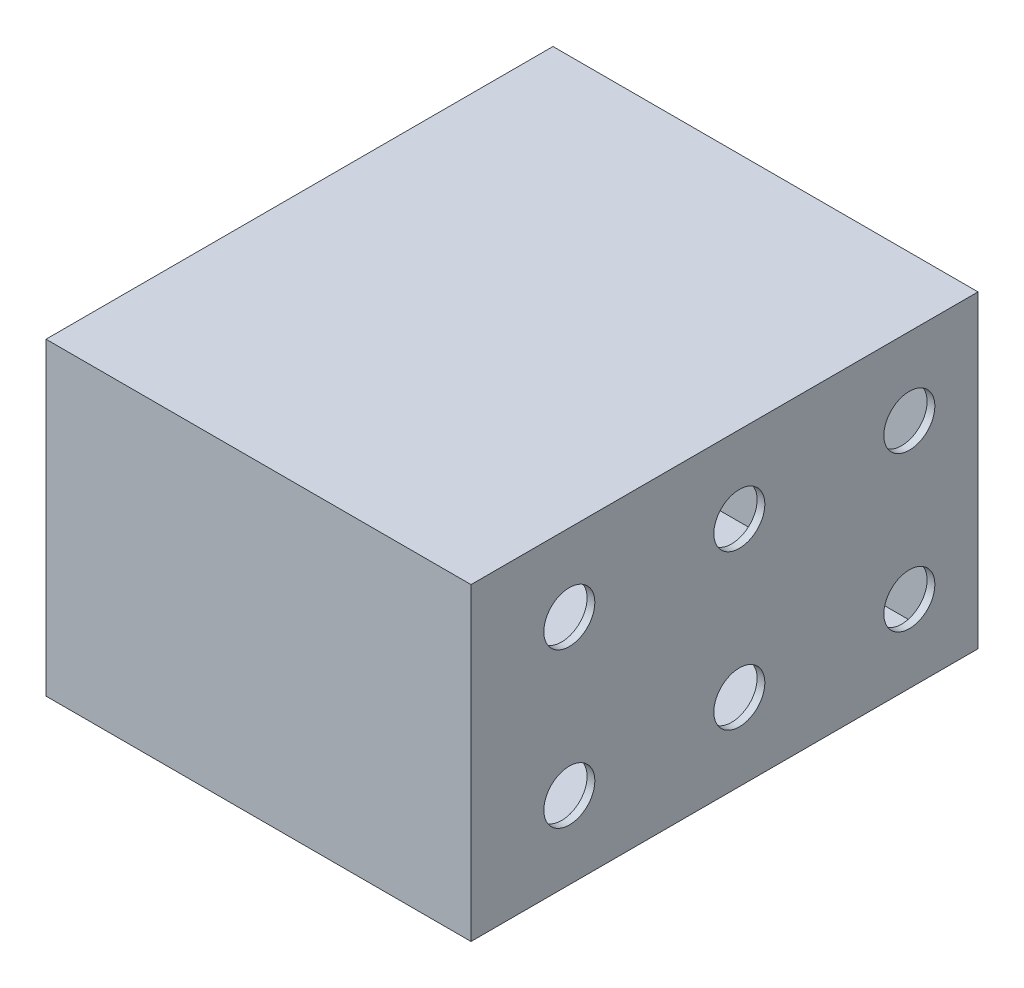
ISO-10303-21;
HEADER;
FILE_DESCRIPTION(('STEP AP214'),'2;1');
FILE_NAME('part.step','',(''),(''),'','','');
FILE_SCHEMA(('AUTOMOTIVE_DESIGN { 1 0 10303 214 1 1 1 1 }'));
ENDSEC;
DATA;
#1=APPLICATION_CONTEXT('core data for automotive mechanical design processes');
#2=APPLICATION_PROTOCOL_DEFINITION('international standard','automotive_design',2000,#1);
#3=PRODUCT_CONTEXT('',#1,'mechanical');
#4=PRODUCT('Part','Part','',(#3));
#5=PRODUCT_RELATED_PRODUCT_CATEGORY('part','',(#4));
#6=PRODUCT_DEFINITION_FORMATION('','',#4);
#7=PRODUCT_DEFINITION_CONTEXT('part definition',#1,'design');
#8=PRODUCT_DEFINITION('design','',#6,#7);
#9=PRODUCT_DEFINITION_SHAPE('','',#8);
#10=(LENGTH_UNIT() NAMED_UNIT(*) SI_UNIT(.MILLI.,.METRE.));
#11=(NAMED_UNIT(*) PLANE_ANGLE_UNIT() SI_UNIT($,.RADIAN.));
#12=(NAMED_UNIT(*) SI_UNIT($,.STERADIAN.) SOLID_ANGLE_UNIT());
#13=UNCERTAINTY_MEASURE_WITH_UNIT(LENGTH_MEASURE(1.E-05),#10,'distance_accuracy_value','');
#14=(GEOMETRIC_REPRESENTATION_CONTEXT(3) GLOBAL_UNCERTAINTY_ASSIGNED_CONTEXT((#13)) GLOBAL_UNIT_ASSIGNED_CONTEXT((#10,
#11,#12)) REPRESENTATION_CONTEXT('',''));
#15=CARTESIAN_POINT('',(0.,0.,0.));
#16=DIRECTION('',(0.,0.,1.));
#17=DIRECTION('',(1.,0.,0.));
#18=AXIS2_PLACEMENT_3D('',#15,#16,#17);
#19=CARTESIAN_POINT('',(26.5,15.,-25.5584012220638));
#20=DIRECTION('',(1.,0.,0.));
#21=DIRECTION('',(0.,0.,-1.));
#22=AXIS2_PLACEMENT_3D('',#19,#20,#21);
#23=CYLINDRICAL_SURFACE('',#22,1.65);
#24=CARTESIAN_POINT('',(27.5,15.,-25.5584012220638));
#25=DIRECTION('',(1.,0.,0.));
#26=DIRECTION('',(0.,0.,-1.));
#27=AXIS2_PLACEMENT_3D('',#24,#25,#26);
#28=CIRCLE('',#27,1.65);
#29=CARTESIAN_POINT('',(27.5,15.,-27.2084012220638));
#30=VERTEX_POINT('',#29);
#31=EDGE_CURVE('E48',#30,#30,#28,.T.);
#32=ORIENTED_EDGE('',*,*,#31,.T.);
#33=EDGE_LOOP('',(#32));
#34=FACE_BOUND('',#33,.T.);
#35=CARTESIAN_POINT('',(27.,15.,-25.5584012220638));
#36=DIRECTION('',(1.,0.,0.));
#37=DIRECTION('',(0.,0.,-1.));
#38=AXIS2_PLACEMENT_3D('',#35,#36,#37);
#39=CIRCLE('',#38,1.65);
#40=CARTESIAN_POINT('',(27.,15.,-27.2084012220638));
#41=VERTEX_POINT('',#40);
#42=EDGE_CURVE('E11',#41,#41,#39,.T.);
#43=ORIENTED_EDGE('',*,*,#42,.F.);
#44=EDGE_LOOP('',(#43));
#45=FACE_BOUND('',#44,.T.);
#46=ADVANCED_FACE('F41',(#34,#45),#23,.F.);
#47=CARTESIAN_POINT('',(26.5,5.,-25.5584012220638));
#48=DIRECTION('',(1.,0.,0.));
#49=DIRECTION('',(0.,0.,-1.));
#50=AXIS2_PLACEMENT_3D('',#47,#48,#49);
#51=CYLINDRICAL_SURFACE('',#50,1.65);
#52=CARTESIAN_POINT('',(27.5,5.,-25.5584012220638));
#53=DIRECTION('',(1.,0.,0.));
#54=DIRECTION('',(0.,0.,-1.));
#55=AXIS2_PLACEMENT_3D('',#52,#53,#54);
#56=CIRCLE('',#55,1.65);
#57=CARTESIAN_POINT('',(27.5,5.,-27.2084012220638));
#58=VERTEX_POINT('',#57);
#59=EDGE_CURVE('E185',#58,#58,#56,.T.);
#60=ORIENTED_EDGE('',*,*,#59,.T.);
#61=EDGE_LOOP('',(#60));
#62=FACE_BOUND('',#61,.T.);
#63=CARTESIAN_POINT('',(27.,5.,-25.5584012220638));
#64=DIRECTION('',(1.,0.,0.));
#65=DIRECTION('',(0.,0.,-1.));
#66=AXIS2_PLACEMENT_3D('',#63,#64,#65);
#67=CIRCLE('',#66,1.65);
#68=CARTESIAN_POINT('',(27.,5.,-27.2084012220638));
#69=VERTEX_POINT('',#68);
#70=EDGE_CURVE('E193',#69,#69,#67,.T.);
#71=ORIENTED_EDGE('',*,*,#70,.F.);
#72=EDGE_LOOP('',(#71));
#73=FACE_BOUND('',#72,.T.);
#74=ADVANCED_FACE('F217',(#62,#73),#51,.F.);
#75=CARTESIAN_POINT('',(27.5,0.,-30.));
#76=DIRECTION('',(0.,0.,1.));
#77=DIRECTION('',(1.,0.,0.));
#78=AXIS2_PLACEMENT_3D('',#75,#76,#77);
#79=PLANE('',#78);
#80=DIRECTION('',(0.,1.,0.));
#81=VECTOR('',#80,1.);
#82=CARTESIAN_POINT('',(0.,0.,-30.));
#83=LINE('',#82,#81);
#84=CARTESIAN_POINT('',(0.,0.,-30.));
#85=VERTEX_POINT('',#84);
#86=CARTESIAN_POINT('',(0.,20.,-30.));
#87=VERTEX_POINT('',#86);
#88=EDGE_CURVE('E156',#85,#87,#83,.T.);
#89=ORIENTED_EDGE('',*,*,#88,.T.);
#90=DIRECTION('',(-1.,0.,0.));
#91=VECTOR('',#90,1.);
#92=CARTESIAN_POINT('',(27.5,20.,-30.));
#93=LINE('',#92,#91);
#94=CARTESIAN_POINT('',(27.5,20.,-30.));
#95=VERTEX_POINT('',#94);
#96=EDGE_CURVE('E179',#95,#87,#93,.T.);
#97=ORIENTED_EDGE('',*,*,#96,.F.);
#98=DIRECTION('',(0.,1.,0.));
#99=VECTOR('',#98,1.);
#100=CARTESIAN_POINT('',(27.5,0.,-30.));
#101=LINE('',#100,#99);
#102=CARTESIAN_POINT('',(27.5,0.,-30.));
#103=VERTEX_POINT('',#102);
#104=EDGE_CURVE('E94',#103,#95,#101,.T.);
#105=ORIENTED_EDGE('',*,*,#104,.F.);
#106=DIRECTION('',(-1.,0.,0.));
#107=VECTOR('',#106,1.);
#108=CARTESIAN_POINT('',(27.5,0.,-30.));
#109=LINE('',#108,#107);
#110=EDGE_CURVE('E176',#103,#85,#109,.T.);
#111=ORIENTED_EDGE('',*,*,#110,.T.);
#112=EDGE_LOOP('',(#89,#97,#105,#111));
#113=FACE_BOUND('',#112,.T.);
#114=ADVANCED_FACE('F225',(#113),#79,.F.);
#115=CARTESIAN_POINT('',(27.5,20.,2.80262364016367));
#116=DIRECTION('',(0.,-1.,0.));
#117=DIRECTION('',(0.,0.,-1.));
#118=AXIS2_PLACEMENT_3D('',#115,#116,#117);
#119=PLANE('',#118);
#120=DIRECTION('',(0.,0.,1.));
#121=VECTOR('',#120,1.);
#122=CARTESIAN_POINT('',(0.,20.,2.80262364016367));
#123=LINE('',#122,#121);
#124=CARTESIAN_POINT('',(0.,20.,2.80262364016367));
#125=VERTEX_POINT('',#124);
#126=EDGE_CURVE('E168',#87,#125,#123,.T.);
#127=ORIENTED_EDGE('',*,*,#126,.T.);
#128=DIRECTION('',(-1.,0.,0.));
#129=VECTOR('',#128,1.);
#130=CARTESIAN_POINT('',(27.5,20.,2.80262364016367));
#131=LINE('',#130,#129);
#132=CARTESIAN_POINT('',(27.5,20.,2.80262364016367));
#133=VERTEX_POINT('',#132);
#134=EDGE_CURVE('E171',#133,#125,#131,.T.);
#135=ORIENTED_EDGE('',*,*,#134,.F.);
#136=DIRECTION('',(0.,0.,1.));
#137=VECTOR('',#136,1.);
#138=CARTESIAN_POINT('',(27.5,20.,0.));
#139=LINE('',#138,#137);
#140=EDGE_CURVE('E162',#95,#133,#139,.T.);
#141=ORIENTED_EDGE('',*,*,#140,.F.);
#142=ORIENTED_EDGE('',*,*,#96,.T.);
#143=EDGE_LOOP('',(#127,#135,#141,#142));
#144=FACE_BOUND('',#143,.T.);
#145=ADVANCED_FACE('F230',(#144),#119,.F.);
#146=CARTESIAN_POINT('',(27.5,0.,2.80262364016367));
#147=DIRECTION('',(0.,0.,-1.));
#148=DIRECTION('',(-1.,0.,0.));
#149=AXIS2_PLACEMENT_3D('',#146,#147,#148);
#150=PLANE('',#149);
#151=DIRECTION('',(0.,-1.,0.));
#152=VECTOR('',#151,1.);
#153=CARTESIAN_POINT('',(0.,0.,2.80262364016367));
#154=LINE('',#153,#152);
#155=CARTESIAN_POINT('',(0.,0.,2.80262364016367));
#156=VERTEX_POINT('',#155);
#157=EDGE_CURVE('E87',#125,#156,#154,.T.);
#158=ORIENTED_EDGE('',*,*,#157,.T.);
#159=DIRECTION('',(-1.,0.,0.));
#160=VECTOR('',#159,1.);
#161=CARTESIAN_POINT('',(27.5,0.,2.80262364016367));
#162=LINE('',#161,#160);
#163=CARTESIAN_POINT('',(27.5,0.,2.80262364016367));
#164=VERTEX_POINT('',#163);
#165=EDGE_CURVE('E170',#164,#156,#162,.T.);
#166=ORIENTED_EDGE('',*,*,#165,.F.);
#167=DIRECTION('',(0.,-1.,0.));
#168=VECTOR('',#167,1.);
#169=CARTESIAN_POINT('',(27.5,0.,2.80262364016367));
#170=LINE('',#169,#168);
#171=EDGE_CURVE('E164',#133,#164,#170,.T.);
#172=ORIENTED_EDGE('',*,*,#171,.F.);
#173=ORIENTED_EDGE('',*,*,#134,.T.);
#174=EDGE_LOOP('',(#158,#166,#172,#173));
#175=FACE_BOUND('',#174,.T.);
#176=ADVANCED_FACE('F215',(#175),#150,.F.);
#177=CARTESIAN_POINT('',(27.5,0.,0.));
#178=DIRECTION('',(0.,1.,0.));
#179=DIRECTION('',(0.,0.,1.));
#180=AXIS2_PLACEMENT_3D('',#177,#178,#179);
#181=PLANE('',#180);
#182=DIRECTION('',(0.,0.,-1.));
#183=VECTOR('',#182,1.);
#184=CARTESIAN_POINT('',(0.,0.,0.));
#185=LINE('',#184,#183);
#186=EDGE_CURVE('E161',#156,#85,#185,.T.);
#187=ORIENTED_EDGE('',*,*,#186,.T.);
#188=ORIENTED_EDGE('',*,*,#110,.F.);
#189=DIRECTION('',(0.,0.,-1.));
#190=VECTOR('',#189,1.);
#191=CARTESIAN_POINT('',(27.5,0.,0.));
#192=LINE('',#191,#190);
#193=EDGE_CURVE('E64',#164,#103,#192,.T.);
#194=ORIENTED_EDGE('',*,*,#193,.F.);
#195=ORIENTED_EDGE('',*,*,#165,.T.);
#196=EDGE_LOOP('',(#187,#188,#194,#195));
#197=FACE_BOUND('',#196,.T.);
#198=ADVANCED_FACE('F203',(#197),#181,.F.);
#199=CARTESIAN_POINT('',(27.5,0.,0.));
#200=DIRECTION('',(1.,0.,0.));
#201=DIRECTION('',(0.,0.,-1.));
#202=AXIS2_PLACEMENT_3D('',#199,#200,#201);
#203=PLANE('',#202);
#204=CARTESIAN_POINT('',(27.5,15.,-14.5584012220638));
#205=DIRECTION('',(1.,0.,0.));
#206=DIRECTION('',(0.,0.,-1.));
#207=AXIS2_PLACEMENT_3D('',#204,#205,#206);
#208=CIRCLE('',#207,1.65);
#209=CARTESIAN_POINT('',(27.5,15.,-16.2084012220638));
#210=VERTEX_POINT('',#209);
#211=EDGE_CURVE('E371',#210,#210,#208,.T.);
#212=ORIENTED_EDGE('',*,*,#211,.F.);
#213=EDGE_LOOP('',(#212));
#214=FACE_BOUND('',#213,.T.);
#215=CARTESIAN_POINT('',(27.5,5.,-14.5584012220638));
#216=DIRECTION('',(1.,0.,0.));
#217=DIRECTION('',(0.,0.,-1.));
#218=AXIS2_PLACEMENT_3D('',#215,#216,#217);
#219=CIRCLE('',#218,1.65);
#220=CARTESIAN_POINT('',(27.5,5.,-16.2084012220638));
#221=VERTEX_POINT('',#220);
#222=EDGE_CURVE('E348',#221,#221,#219,.T.);
#223=ORIENTED_EDGE('',*,*,#222,.F.);
#224=EDGE_LOOP('',(#223));
#225=FACE_BOUND('',#224,.T.);
#226=CARTESIAN_POINT('',(27.5,5.,-3.55840122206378));
#227=DIRECTION('',(1.,0.,0.));
#228=DIRECTION('',(0.,0.,-1.));
#229=AXIS2_PLACEMENT_3D('',#226,#227,#228);
#230=CIRCLE('',#229,1.65);
#231=CARTESIAN_POINT('',(27.5,5.,-5.20840122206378));
#232=VERTEX_POINT('',#231);
#233=EDGE_CURVE('E187',#232,#232,#230,.T.);
#234=ORIENTED_EDGE('',*,*,#233,.F.);
#235=EDGE_LOOP('',(#234));
#236=FACE_BOUND('',#235,.T.);
#237=CARTESIAN_POINT('',(27.5,15.,-3.55840122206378));
#238=DIRECTION('',(1.,0.,0.));
#239=DIRECTION('',(0.,0.,-1.));
#240=AXIS2_PLACEMENT_3D('',#237,#238,#239);
#241=CIRCLE('',#240,1.65);
#242=CARTESIAN_POINT('',(27.5,15.,-5.20840122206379));
#243=VERTEX_POINT('',#242);
#244=EDGE_CURVE('E141',#243,#243,#241,.T.);
#245=ORIENTED_EDGE('',*,*,#244,.F.);
#246=EDGE_LOOP('',(#245));
#247=FACE_BOUND('',#246,.T.);
#248=ORIENTED_EDGE('',*,*,#193,.T.);
#249=ORIENTED_EDGE('',*,*,#104,.T.);
#250=ORIENTED_EDGE('',*,*,#140,.T.);
#251=ORIENTED_EDGE('',*,*,#171,.T.);
#252=EDGE_LOOP('',(#248,#249,#250,#251));
#253=FACE_BOUND('',#252,.T.);
#254=ORIENTED_EDGE('',*,*,#59,.F.);
#255=EDGE_LOOP('',(#254));
#256=FACE_BOUND('',#255,.T.);
#257=ORIENTED_EDGE('',*,*,#31,.F.);
#258=EDGE_LOOP('',(#257));
#259=FACE_BOUND('',#258,.T.);
#260=ADVANCED_FACE('F196',(#214,#225,#236,#247,#253,#256,#259),#203,.T.);
#261=CARTESIAN_POINT('',(0.,0.,0.));
#262=DIRECTION('',(1.,0.,0.));
#263=DIRECTION('',(0.,0.,-1.));
#264=AXIS2_PLACEMENT_3D('',#261,#262,#263);
#265=PLANE('',#264);
#266=DIRECTION('',(0.,1.,0.));
#267=VECTOR('',#266,1.);
#268=CARTESIAN_POINT('',(0.,19.639542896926,1.99062042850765));
#269=LINE('',#268,#267);
#270=CARTESIAN_POINT('',(0.,0.360457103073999,1.99062042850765));
#271=VERTEX_POINT('',#270);
#272=CARTESIAN_POINT('',(0.,19.639542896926,1.99062042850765));
#273=VERTEX_POINT('',#272);
#274=EDGE_CURVE('E149',#271,#273,#269,.T.);
#275=ORIENTED_EDGE('',*,*,#274,.F.);
#276=DIRECTION('',(0.,0.,1.));
#277=VECTOR('',#276,1.);
#278=CARTESIAN_POINT('',(0.,0.360457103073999,-29.0332451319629));
#279=LINE('',#278,#277);
#280=CARTESIAN_POINT('',(0.,0.360457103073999,-29.0332451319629));
#281=VERTEX_POINT('',#280);
#282=EDGE_CURVE('E54',#281,#271,#279,.T.);
#283=ORIENTED_EDGE('',*,*,#282,.F.);
#284=DIRECTION('',(0.,-1.,0.));
#285=VECTOR('',#284,1.);
#286=CARTESIAN_POINT('',(0.,19.639542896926,-29.0332451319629));
#287=LINE('',#286,#285);
#288=CARTESIAN_POINT('',(0.,19.639542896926,-29.0332451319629));
#289=VERTEX_POINT('',#288);
#290=EDGE_CURVE('E139',#289,#281,#287,.T.);
#291=ORIENTED_EDGE('',*,*,#290,.F.);
#292=DIRECTION('',(0.,0.,-1.));
#293=VECTOR('',#292,1.);
#294=CARTESIAN_POINT('',(0.,19.639542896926,-29.0332451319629));
#295=LINE('',#294,#293);
#296=EDGE_CURVE('E136',#273,#289,#295,.T.);
#297=ORIENTED_EDGE('',*,*,#296,.F.);
#298=EDGE_LOOP('',(#275,#283,#291,#297));
#299=FACE_BOUND('',#298,.T.);
#300=ORIENTED_EDGE('',*,*,#88,.F.);
#301=ORIENTED_EDGE('',*,*,#186,.F.);
#302=ORIENTED_EDGE('',*,*,#157,.F.);
#303=ORIENTED_EDGE('',*,*,#126,.F.);
#304=EDGE_LOOP('',(#300,#301,#302,#303));
#305=FACE_BOUND('',#304,.T.);
#306=ADVANCED_FACE('F199',(#299,#305),#265,.F.);
#307=CARTESIAN_POINT('',(27.,0.360457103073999,-29.0332451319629));
#308=DIRECTION('',(0.,-1.,0.));
#309=DIRECTION('',(0.,0.,-1.));
#310=AXIS2_PLACEMENT_3D('',#307,#308,#309);
#311=PLANE('',#310);
#312=ORIENTED_EDGE('',*,*,#282,.T.);
#313=DIRECTION('',(-1.,0.,0.));
#314=VECTOR('',#313,1.);
#315=CARTESIAN_POINT('',(27.,0.360457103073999,1.99062042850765));
#316=LINE('',#315,#314);
#317=CARTESIAN_POINT('',(27.,0.360457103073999,1.99062042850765));
#318=VERTEX_POINT('',#317);
#319=EDGE_CURVE('E111',#318,#271,#316,.T.);
#320=ORIENTED_EDGE('',*,*,#319,.F.);
#321=DIRECTION('',(0.,0.,1.));
#322=VECTOR('',#321,1.);
#323=CARTESIAN_POINT('',(27.,0.360457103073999,-29.0332451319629));
#324=LINE('',#323,#322);
#325=CARTESIAN_POINT('',(27.,0.360457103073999,-29.0332451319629));
#326=VERTEX_POINT('',#325);
#327=EDGE_CURVE('E118',#326,#318,#324,.T.);
#328=ORIENTED_EDGE('',*,*,#327,.F.);
#329=DIRECTION('',(-1.,0.,0.));
#330=VECTOR('',#329,1.);
#331=CARTESIAN_POINT('',(27.,0.360457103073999,-29.0332451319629));
#332=LINE('',#331,#330);
#333=EDGE_CURVE('E152',#326,#281,#332,.T.);
#334=ORIENTED_EDGE('',*,*,#333,.T.);
#335=EDGE_LOOP('',(#312,#320,#328,#334));
#336=FACE_BOUND('',#335,.T.);
#337=ADVANCED_FACE('F117',(#336),#311,.F.);
#338=CARTESIAN_POINT('',(27.,19.639542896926,-29.0332451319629));
#339=DIRECTION('',(0.,0.,-1.));
#340=DIRECTION('',(-1.,0.,0.));
#341=AXIS2_PLACEMENT_3D('',#338,#339,#340);
#342=PLANE('',#341);
#343=ORIENTED_EDGE('',*,*,#290,.T.);
#344=ORIENTED_EDGE('',*,*,#333,.F.);
#345=DIRECTION('',(0.,-1.,0.));
#346=VECTOR('',#345,1.);
#347=CARTESIAN_POINT('',(27.,19.639542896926,-29.0332451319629));
#348=LINE('',#347,#346);
#349=CARTESIAN_POINT('',(27.,19.639542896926,-29.0332451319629));
#350=VERTEX_POINT('',#349);
#351=EDGE_CURVE('E125',#350,#326,#348,.T.);
#352=ORIENTED_EDGE('',*,*,#351,.F.);
#353=DIRECTION('',(-1.,0.,0.));
#354=VECTOR('',#353,1.);
#355=CARTESIAN_POINT('',(27.,19.639542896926,-29.0332451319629));
#356=LINE('',#355,#354);
#357=EDGE_CURVE('E160',#350,#289,#356,.T.);
#358=ORIENTED_EDGE('',*,*,#357,.T.);
#359=EDGE_LOOP('',(#343,#344,#352,#358));
#360=FACE_BOUND('',#359,.T.);
#361=ADVANCED_FACE('F260',(#360),#342,.F.);
#362=CARTESIAN_POINT('',(27.,19.639542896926,-29.0332451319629));
#363=DIRECTION('',(0.,1.,0.));
#364=DIRECTION('',(0.,0.,1.));
#365=AXIS2_PLACEMENT_3D('',#362,#363,#364);
#366=PLANE('',#365);
#367=ORIENTED_EDGE('',*,*,#296,.T.);
#368=ORIENTED_EDGE('',*,*,#357,.F.);
#369=DIRECTION('',(0.,0.,-1.));
#370=VECTOR('',#369,1.);
#371=CARTESIAN_POINT('',(27.,19.639542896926,-29.0332451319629));
#372=LINE('',#371,#370);
#373=CARTESIAN_POINT('',(27.,19.639542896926,1.99062042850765));
#374=VERTEX_POINT('',#373);
#375=EDGE_CURVE('E135',#374,#350,#372,.T.);
#376=ORIENTED_EDGE('',*,*,#375,.F.);
#377=DIRECTION('',(-1.,0.,0.));
#378=VECTOR('',#377,1.);
#379=CARTESIAN_POINT('',(27.,19.639542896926,1.99062042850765));
#380=LINE('',#379,#378);
#381=EDGE_CURVE('E122',#374,#273,#380,.T.);
#382=ORIENTED_EDGE('',*,*,#381,.T.);
#383=EDGE_LOOP('',(#367,#368,#376,#382));
#384=FACE_BOUND('',#383,.T.);
#385=ADVANCED_FACE('F262',(#384),#366,.F.);
#386=CARTESIAN_POINT('',(27.,19.639542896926,1.99062042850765));
#387=DIRECTION('',(0.,0.,1.));
#388=DIRECTION('',(1.,0.,0.));
#389=AXIS2_PLACEMENT_3D('',#386,#387,#388);
#390=PLANE('',#389);
#391=ORIENTED_EDGE('',*,*,#274,.T.);
#392=ORIENTED_EDGE('',*,*,#381,.F.);
#393=DIRECTION('',(0.,1.,0.));
#394=VECTOR('',#393,1.);
#395=CARTESIAN_POINT('',(27.,19.639542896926,1.99062042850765));
#396=LINE('',#395,#394);
#397=EDGE_CURVE('E130',#318,#374,#396,.T.);
#398=ORIENTED_EDGE('',*,*,#397,.F.);
#399=ORIENTED_EDGE('',*,*,#319,.T.);
#400=EDGE_LOOP('',(#391,#392,#398,#399));
#401=FACE_BOUND('',#400,.T.);
#402=ADVANCED_FACE('F126',(#401),#390,.F.);
#403=CARTESIAN_POINT('',(27.,0.,0.));
#404=DIRECTION('',(1.,0.,0.));
#405=DIRECTION('',(0.,0.,-1.));
#406=AXIS2_PLACEMENT_3D('',#403,#404,#405);
#407=PLANE('',#406);
#408=CARTESIAN_POINT('',(27.,15.,-14.5584012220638));
#409=DIRECTION('',(1.,0.,0.));
#410=DIRECTION('',(0.,0.,-1.));
#411=AXIS2_PLACEMENT_3D('',#408,#409,#410);
#412=CIRCLE('',#411,1.65);
#413=CARTESIAN_POINT('',(27.,15.,-16.2084012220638));
#414=VERTEX_POINT('',#413);
#415=EDGE_CURVE('E339',#414,#414,#412,.T.);
#416=ORIENTED_EDGE('',*,*,#415,.T.);
#417=EDGE_LOOP('',(#416));
#418=FACE_BOUND('',#417,.T.);
#419=CARTESIAN_POINT('',(27.,5.,-14.5584012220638));
#420=DIRECTION('',(1.,0.,0.));
#421=DIRECTION('',(0.,0.,-1.));
#422=AXIS2_PLACEMENT_3D('',#419,#420,#421);
#423=CIRCLE('',#422,1.65);
#424=CARTESIAN_POINT('',(27.,5.,-16.2084012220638));
#425=VERTEX_POINT('',#424);
#426=EDGE_CURVE('E342',#425,#425,#423,.T.);
#427=ORIENTED_EDGE('',*,*,#426,.T.);
#428=EDGE_LOOP('',(#427));
#429=FACE_BOUND('',#428,.T.);
#430=CARTESIAN_POINT('',(27.,5.,-3.55840122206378));
#431=DIRECTION('',(1.,0.,0.));
#432=DIRECTION('',(0.,0.,-1.));
#433=AXIS2_PLACEMENT_3D('',#430,#431,#432);
#434=CIRCLE('',#433,1.65);
#435=CARTESIAN_POINT('',(27.,5.,-5.20840122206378));
#436=VERTEX_POINT('',#435);
#437=EDGE_CURVE('E147',#436,#436,#434,.T.);
#438=ORIENTED_EDGE('',*,*,#437,.T.);
#439=EDGE_LOOP('',(#438));
#440=FACE_BOUND('',#439,.T.);
#441=CARTESIAN_POINT('',(27.,15.,-3.55840122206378));
#442=DIRECTION('',(1.,0.,0.));
#443=DIRECTION('',(0.,0.,-1.));
#444=AXIS2_PLACEMENT_3D('',#441,#442,#443);
#445=CIRCLE('',#444,1.65);
#446=CARTESIAN_POINT('',(27.,15.,-5.20840122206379));
#447=VERTEX_POINT('',#446);
#448=EDGE_CURVE('E181',#447,#447,#445,.T.);
#449=ORIENTED_EDGE('',*,*,#448,.T.);
#450=EDGE_LOOP('',(#449));
#451=FACE_BOUND('',#450,.T.);
#452=ORIENTED_EDGE('',*,*,#327,.T.);
#453=ORIENTED_EDGE('',*,*,#397,.T.);
#454=ORIENTED_EDGE('',*,*,#375,.T.);
#455=ORIENTED_EDGE('',*,*,#351,.T.);
#456=EDGE_LOOP('',(#452,#453,#454,#455));
#457=FACE_BOUND('',#456,.T.);
#458=ORIENTED_EDGE('',*,*,#70,.T.);
#459=EDGE_LOOP('',(#458));
#460=FACE_BOUND('',#459,.T.);
#461=ORIENTED_EDGE('',*,*,#42,.T.);
#462=EDGE_LOOP('',(#461));
#463=FACE_BOUND('',#462,.T.);
#464=ADVANCED_FACE('F134',(#418,#429,#440,#451,#457,#460,#463),#407,.F.);
#465=CARTESIAN_POINT('',(26.5,15.,-3.55840122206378));
#466=DIRECTION('',(1.,0.,0.));
#467=DIRECTION('',(0.,0.,-1.));
#468=AXIS2_PLACEMENT_3D('',#465,#466,#467);
#469=CYLINDRICAL_SURFACE('',#468,1.65);
#470=ORIENTED_EDGE('',*,*,#244,.T.);
#471=EDGE_LOOP('',(#470));
#472=FACE_BOUND('',#471,.T.);
#473=ORIENTED_EDGE('',*,*,#448,.F.);
#474=EDGE_LOOP('',(#473));
#475=FACE_BOUND('',#474,.T.);
#476=ADVANCED_FACE('F288',(#472,#475),#469,.F.);
#477=CARTESIAN_POINT('',(26.5,5.,-3.55840122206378));
#478=DIRECTION('',(1.,0.,0.));
#479=DIRECTION('',(0.,0.,-1.));
#480=AXIS2_PLACEMENT_3D('',#477,#478,#479);
#481=CYLINDRICAL_SURFACE('',#480,1.65);
#482=ORIENTED_EDGE('',*,*,#233,.T.);
#483=EDGE_LOOP('',(#482));
#484=FACE_BOUND('',#483,.T.);
#485=ORIENTED_EDGE('',*,*,#437,.F.);
#486=EDGE_LOOP('',(#485));
#487=FACE_BOUND('',#486,.T.);
#488=ADVANCED_FACE('F290',(#484,#487),#481,.F.);
#489=CARTESIAN_POINT('',(26.5,5.,-14.5584012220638));
#490=DIRECTION('',(1.,0.,0.));
#491=DIRECTION('',(0.,0.,-1.));
#492=AXIS2_PLACEMENT_3D('',#489,#490,#491);
#493=CYLINDRICAL_SURFACE('',#492,1.65);
#494=ORIENTED_EDGE('',*,*,#222,.T.);
#495=EDGE_LOOP('',(#494));
#496=FACE_BOUND('',#495,.T.);
#497=ORIENTED_EDGE('',*,*,#426,.F.);
#498=EDGE_LOOP('',(#497));
#499=FACE_BOUND('',#498,.T.);
#500=ADVANCED_FACE('F300',(#496,#499),#493,.F.);
#501=CARTESIAN_POINT('',(26.5,15.,-14.5584012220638));
#502=DIRECTION('',(1.,0.,0.));
#503=DIRECTION('',(0.,0.,-1.));
#504=AXIS2_PLACEMENT_3D('',#501,#502,#503);
#505=CYLINDRICAL_SURFACE('',#504,1.65);
#506=ORIENTED_EDGE('',*,*,#211,.T.);
#507=EDGE_LOOP('',(#506));
#508=FACE_BOUND('',#507,.T.);
#509=ORIENTED_EDGE('',*,*,#415,.F.);
#510=EDGE_LOOP('',(#509));
#511=FACE_BOUND('',#510,.T.);
#512=ADVANCED_FACE('F317',(#508,#511),#505,.F.);
#513=CLOSED_SHELL('',(#46,#74,#114,#145,#176,#198,#260,#306,#337,#361,#385,#402,#464,#476,#488,
#500,#512));
#514=MANIFOLD_SOLID_BREP('B2',#513);
#515=ADVANCED_BREP_SHAPE_REPRESENTATION('',(#18,#514),#14);
#516=SHAPE_DEFINITION_REPRESENTATION(#9,#515);
ENDSEC;
END-ISO-10303-21;
